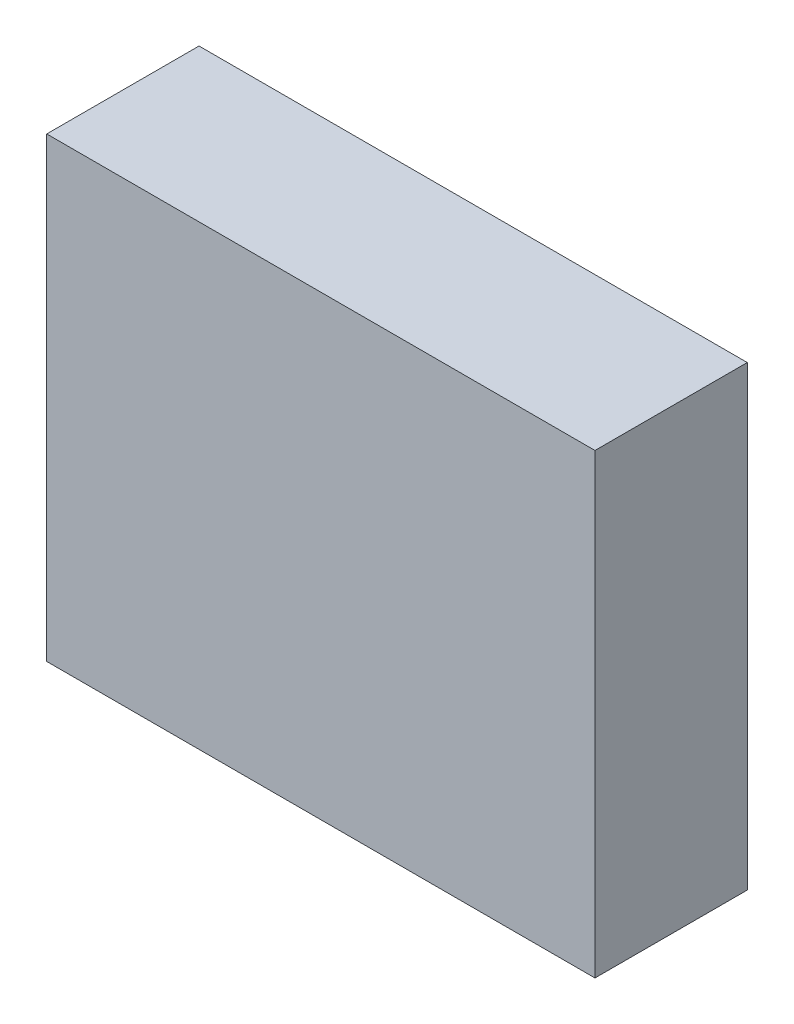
ISO-10303-21;
HEADER;
FILE_DESCRIPTION(('STEP AP214'),'2;1');
FILE_NAME('part.step','',(''),(''),'','','');
FILE_SCHEMA(('AUTOMOTIVE_DESIGN { 1 0 10303 214 1 1 1 1 }'));
ENDSEC;
DATA;
#1=APPLICATION_CONTEXT('core data for automotive mechanical design processes');
#2=APPLICATION_PROTOCOL_DEFINITION('international standard','automotive_design',2000,#1);
#3=PRODUCT_CONTEXT('',#1,'mechanical');
#4=PRODUCT('Part','Part','',(#3));
#5=PRODUCT_RELATED_PRODUCT_CATEGORY('part','',(#4));
#6=PRODUCT_DEFINITION_FORMATION('','',#4);
#7=PRODUCT_DEFINITION_CONTEXT('part definition',#1,'design');
#8=PRODUCT_DEFINITION('design','',#6,#7);
#9=PRODUCT_DEFINITION_SHAPE('','',#8);
#10=(LENGTH_UNIT() NAMED_UNIT(*) SI_UNIT(.MILLI.,.METRE.));
#11=(NAMED_UNIT(*) PLANE_ANGLE_UNIT() SI_UNIT($,.RADIAN.));
#12=(NAMED_UNIT(*) SI_UNIT($,.STERADIAN.) SOLID_ANGLE_UNIT());
#13=UNCERTAINTY_MEASURE_WITH_UNIT(LENGTH_MEASURE(1.E-05),#10,'distance_accuracy_value','');
#14=(GEOMETRIC_REPRESENTATION_CONTEXT(3) GLOBAL_UNCERTAINTY_ASSIGNED_CONTEXT((#13)) GLOBAL_UNIT_ASSIGNED_CONTEXT((#10,
#11,#12)) REPRESENTATION_CONTEXT('',''));
#15=CARTESIAN_POINT('',(0.,0.,0.));
#16=DIRECTION('',(0.,0.,1.));
#17=DIRECTION('',(1.,0.,0.));
#18=AXIS2_PLACEMENT_3D('',#15,#16,#17);
#19=CARTESIAN_POINT('',(-1.79999999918,1.49999999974,0.99999999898));
#20=DIRECTION('',(1.,0.,0.));
#21=DIRECTION('',(0.,0.,-1.));
#22=AXIS2_PLACEMENT_3D('',#19,#20,#21);
#23=PLANE('',#22);
#24=DIRECTION('',(0.,-1.,0.));
#25=VECTOR('',#24,1.);
#26=CARTESIAN_POINT('',(-1.79999999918,1.49999999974,0.));
#27=LINE('',#26,#25);
#28=CARTESIAN_POINT('',(-1.79999999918,1.49999999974,0.));
#29=VERTEX_POINT('',#28);
#30=CARTESIAN_POINT('',(-1.79999999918,-1.49999999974,0.));
#31=VERTEX_POINT('',#30);
#32=EDGE_CURVE('E96',#29,#31,#27,.T.);
#33=ORIENTED_EDGE('',*,*,#32,.T.);
#34=DIRECTION('',(0.,0.,-1.));
#35=VECTOR('',#34,1.);
#36=CARTESIAN_POINT('',(-1.79999999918,-1.49999999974,0.99999999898));
#37=LINE('',#36,#35);
#38=CARTESIAN_POINT('',(-1.79999999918,-1.49999999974,0.99999999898));
#39=VERTEX_POINT('',#38);
#40=EDGE_CURVE('E11',#39,#31,#37,.T.);
#41=ORIENTED_EDGE('',*,*,#40,.F.);
#42=DIRECTION('',(0.,-1.,0.));
#43=VECTOR('',#42,1.);
#44=CARTESIAN_POINT('',(-1.79999999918,1.49999999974,0.99999999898));
#45=LINE('',#44,#43);
#46=CARTESIAN_POINT('',(-1.79999999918,1.49999999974,0.99999999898));
#47=VERTEX_POINT('',#46);
#48=EDGE_CURVE('E84',#47,#39,#45,.T.);
#49=ORIENTED_EDGE('',*,*,#48,.F.);
#50=DIRECTION('',(0.,0.,-1.));
#51=VECTOR('',#50,1.);
#52=CARTESIAN_POINT('',(-1.79999999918,1.49999999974,0.99999999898));
#53=LINE('',#52,#51);
#54=EDGE_CURVE('E92',#47,#29,#53,.T.);
#55=ORIENTED_EDGE('',*,*,#54,.T.);
#56=EDGE_LOOP('',(#33,#41,#49,#55));
#57=FACE_BOUND('',#56,.T.);
#58=ADVANCED_FACE('F33',(#57),#23,.F.);
#59=CARTESIAN_POINT('',(-1.79999999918,-1.49999999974,0.99999999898));
#60=DIRECTION('',(0.,1.,0.));
#61=DIRECTION('',(0.,0.,1.));
#62=AXIS2_PLACEMENT_3D('',#59,#60,#61);
#63=PLANE('',#62);
#64=DIRECTION('',(1.,0.,0.));
#65=VECTOR('',#64,1.);
#66=CARTESIAN_POINT('',(-1.79999999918,-1.49999999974,0.));
#67=LINE('',#66,#65);
#68=CARTESIAN_POINT('',(1.79999999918,-1.49999999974,0.));
#69=VERTEX_POINT('',#68);
#70=EDGE_CURVE('E88',#31,#69,#67,.T.);
#71=ORIENTED_EDGE('',*,*,#70,.T.);
#72=DIRECTION('',(0.,0.,-1.));
#73=VECTOR('',#72,1.);
#74=CARTESIAN_POINT('',(1.79999999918,-1.49999999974,0.99999999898));
#75=LINE('',#74,#73);
#76=CARTESIAN_POINT('',(1.79999999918,-1.49999999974,0.99999999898));
#77=VERTEX_POINT('',#76);
#78=EDGE_CURVE('E41',#77,#69,#75,.T.);
#79=ORIENTED_EDGE('',*,*,#78,.F.);
#80=DIRECTION('',(1.,0.,0.));
#81=VECTOR('',#80,1.);
#82=CARTESIAN_POINT('',(-1.79999999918,-1.49999999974,0.99999999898));
#83=LINE('',#82,#81);
#84=EDGE_CURVE('E79',#39,#77,#83,.T.);
#85=ORIENTED_EDGE('',*,*,#84,.F.);
#86=ORIENTED_EDGE('',*,*,#40,.T.);
#87=EDGE_LOOP('',(#71,#79,#85,#86));
#88=FACE_BOUND('',#87,.T.);
#89=ADVANCED_FACE('F87',(#88),#63,.F.);
#90=CARTESIAN_POINT('',(1.79999999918,-1.49999999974,0.99999999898));
#91=DIRECTION('',(-1.,0.,0.));
#92=DIRECTION('',(0.,0.,1.));
#93=AXIS2_PLACEMENT_3D('',#90,#91,#92);
#94=PLANE('',#93);
#95=DIRECTION('',(0.,1.,0.));
#96=VECTOR('',#95,1.);
#97=CARTESIAN_POINT('',(1.79999999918,-1.49999999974,0.));
#98=LINE('',#97,#96);
#99=CARTESIAN_POINT('',(1.79999999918,1.49999999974,0.));
#100=VERTEX_POINT('',#99);
#101=EDGE_CURVE('E66',#69,#100,#98,.T.);
#102=ORIENTED_EDGE('',*,*,#101,.T.);
#103=DIRECTION('',(0.,0.,-1.));
#104=VECTOR('',#103,1.);
#105=CARTESIAN_POINT('',(1.79999999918,1.49999999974,0.99999999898));
#106=LINE('',#105,#104);
#107=CARTESIAN_POINT('',(1.79999999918,1.49999999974,0.99999999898));
#108=VERTEX_POINT('',#107);
#109=EDGE_CURVE('E89',#108,#100,#106,.T.);
#110=ORIENTED_EDGE('',*,*,#109,.F.);
#111=DIRECTION('',(0.,1.,0.));
#112=VECTOR('',#111,1.);
#113=CARTESIAN_POINT('',(1.79999999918,-1.49999999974,0.99999999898));
#114=LINE('',#113,#112);
#115=EDGE_CURVE('E82',#77,#108,#114,.T.);
#116=ORIENTED_EDGE('',*,*,#115,.F.);
#117=ORIENTED_EDGE('',*,*,#78,.T.);
#118=EDGE_LOOP('',(#102,#110,#116,#117));
#119=FACE_BOUND('',#118,.T.);
#120=ADVANCED_FACE('F90',(#119),#94,.F.);
#121=CARTESIAN_POINT('',(1.79999999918,1.49999999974,0.99999999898));
#122=DIRECTION('',(0.,-1.,0.));
#123=DIRECTION('',(0.,0.,-1.));
#124=AXIS2_PLACEMENT_3D('',#121,#122,#123);
#125=PLANE('',#124);
#126=DIRECTION('',(-1.,0.,0.));
#127=VECTOR('',#126,1.);
#128=CARTESIAN_POINT('',(1.79999999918,1.49999999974,0.));
#129=LINE('',#128,#127);
#130=EDGE_CURVE('E72',#100,#29,#129,.T.);
#131=ORIENTED_EDGE('',*,*,#130,.T.);
#132=ORIENTED_EDGE('',*,*,#54,.F.);
#133=DIRECTION('',(-1.,0.,0.));
#134=VECTOR('',#133,1.);
#135=CARTESIAN_POINT('',(1.79999999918,1.49999999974,0.99999999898));
#136=LINE('',#135,#134);
#137=EDGE_CURVE('E49',#108,#47,#136,.T.);
#138=ORIENTED_EDGE('',*,*,#137,.F.);
#139=ORIENTED_EDGE('',*,*,#109,.T.);
#140=EDGE_LOOP('',(#131,#132,#138,#139));
#141=FACE_BOUND('',#140,.T.);
#142=ADVANCED_FACE('F103',(#141),#125,.F.);
#143=CARTESIAN_POINT('',(0.,0.,0.99999999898));
#144=DIRECTION('',(0.,0.,1.));
#145=DIRECTION('',(1.,0.,0.));
#146=AXIS2_PLACEMENT_3D('',#143,#144,#145);
#147=PLANE('',#146);
#148=ORIENTED_EDGE('',*,*,#48,.T.);
#149=ORIENTED_EDGE('',*,*,#84,.T.);
#150=ORIENTED_EDGE('',*,*,#115,.T.);
#151=ORIENTED_EDGE('',*,*,#137,.T.);
#152=EDGE_LOOP('',(#148,#149,#150,#151));
#153=FACE_BOUND('',#152,.T.);
#154=ADVANCED_FACE('F80',(#153),#147,.T.);
#155=CARTESIAN_POINT('',(0.,0.,0.));
#156=DIRECTION('',(0.,0.,1.));
#157=DIRECTION('',(1.,0.,0.));
#158=AXIS2_PLACEMENT_3D('',#155,#156,#157);
#159=PLANE('',#158);
#160=ORIENTED_EDGE('',*,*,#32,.F.);
#161=ORIENTED_EDGE('',*,*,#130,.F.);
#162=ORIENTED_EDGE('',*,*,#101,.F.);
#163=ORIENTED_EDGE('',*,*,#70,.F.);
#164=EDGE_LOOP('',(#160,#161,#162,#163));
#165=FACE_BOUND('',#164,.T.);
#166=ADVANCED_FACE('F106',(#165),#159,.F.);
#167=CLOSED_SHELL('',(#58,#89,#120,#142,#154,#166));
#168=MANIFOLD_SOLID_BREP('B2',#167);
#169=ADVANCED_BREP_SHAPE_REPRESENTATION('',(#18,#168),#14);
#170=SHAPE_DEFINITION_REPRESENTATION(#9,#169);
ENDSEC;
END-ISO-10303-21;
